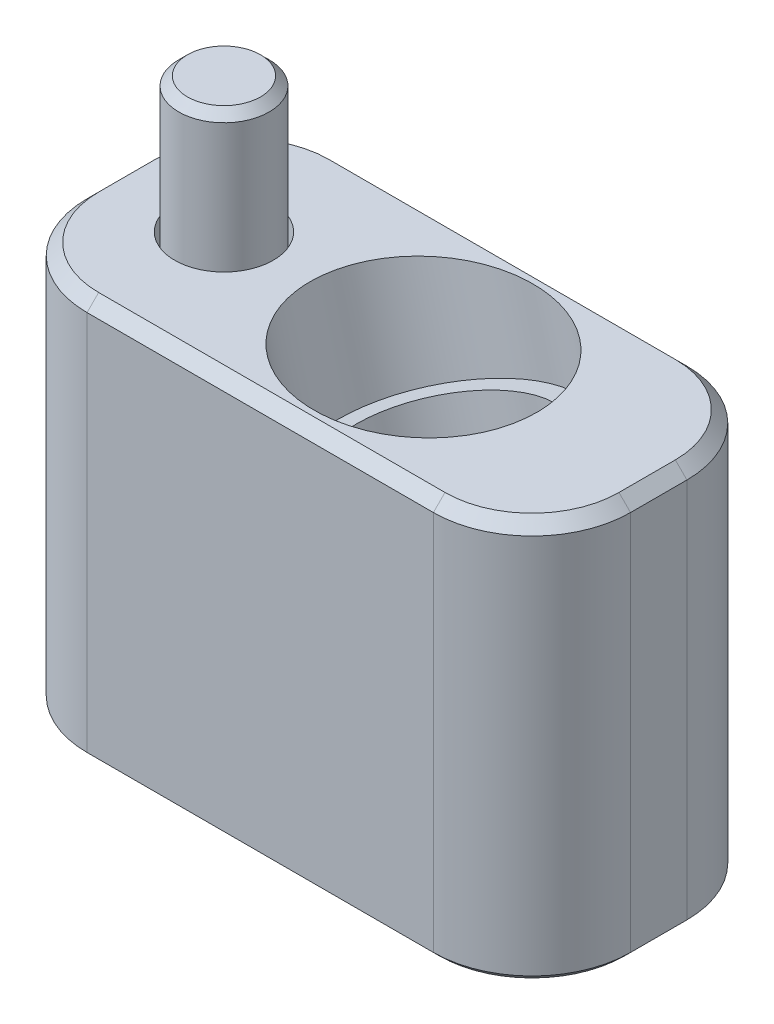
ISO-10303-21;
HEADER;
FILE_DESCRIPTION(('STEP AP214'),'2;1');
FILE_NAME('part.step','',(''),(''),'','','');
FILE_SCHEMA(('AUTOMOTIVE_DESIGN { 1 0 10303 214 1 1 1 1 }'));
ENDSEC;
DATA;
#1=APPLICATION_CONTEXT('core data for automotive mechanical design processes');
#2=APPLICATION_PROTOCOL_DEFINITION('international standard','automotive_design',2000,#1);
#3=PRODUCT_CONTEXT('',#1,'mechanical');
#4=PRODUCT('Part','Part','',(#3));
#5=PRODUCT_RELATED_PRODUCT_CATEGORY('part','',(#4));
#6=PRODUCT_DEFINITION_FORMATION('','',#4);
#7=PRODUCT_DEFINITION_CONTEXT('part definition',#1,'design');
#8=PRODUCT_DEFINITION('design','',#6,#7);
#9=PRODUCT_DEFINITION_SHAPE('','',#8);
#10=(LENGTH_UNIT() NAMED_UNIT(*) SI_UNIT(.MILLI.,.METRE.));
#11=(NAMED_UNIT(*) PLANE_ANGLE_UNIT() SI_UNIT($,.RADIAN.));
#12=(NAMED_UNIT(*) SI_UNIT($,.STERADIAN.) SOLID_ANGLE_UNIT());
#13=UNCERTAINTY_MEASURE_WITH_UNIT(LENGTH_MEASURE(1.E-05),#10,'distance_accuracy_value','');
#14=(GEOMETRIC_REPRESENTATION_CONTEXT(3) GLOBAL_UNCERTAINTY_ASSIGNED_CONTEXT((#13)) GLOBAL_UNIT_ASSIGNED_CONTEXT((#10,
#11,#12)) REPRESENTATION_CONTEXT('',''));
#15=CARTESIAN_POINT('',(0.,0.,0.));
#16=DIRECTION('',(0.,0.,1.));
#17=DIRECTION('',(1.,0.,0.));
#18=AXIS2_PLACEMENT_3D('',#15,#16,#17);
#19=CARTESIAN_POINT('',(-17.4752,11.8364,0.));
#20=DIRECTION('',(0.,1.,0.));
#21=DIRECTION('',(1.,0.,0.));
#22=AXIS2_PLACEMENT_3D('',#19,#20,#21);
#23=PLANE('',#22);
#24=CARTESIAN_POINT('',(-17.4752,11.8364,0.));
#25=DIRECTION('',(0.,1.,0.));
#26=DIRECTION('',(1.,0.,0.));
#27=AXIS2_PLACEMENT_3D('',#24,#25,#26);
#28=CIRCLE('',#27,3.20040000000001);
#29=CARTESIAN_POINT('',(-14.2748,11.8364,0.));
#30=VERTEX_POINT('',#29);
#31=EDGE_CURVE('E163',#30,#30,#28,.T.);
#32=ORIENTED_EDGE('',*,*,#31,.T.);
#33=EDGE_LOOP('',(#32));
#34=FACE_BOUND('',#33,.T.);
#35=ADVANCED_FACE('F50',(#34),#23,.T.);
#36=CARTESIAN_POINT('',(-17.4752,11.8364,0.));
#37=DIRECTION('',(0.,1.,0.));
#38=DIRECTION('',(1.,0.,0.));
#39=AXIS2_PLACEMENT_3D('',#36,#37,#38);
#40=CYLINDRICAL_SURFACE('',#39,3.9624);
#41=CARTESIAN_POINT('',(-17.4752,11.0744,0.));
#42=DIRECTION('',(0.,1.,0.));
#43=DIRECTION('',(1.,0.,0.));
#44=AXIS2_PLACEMENT_3D('',#41,#42,#43);
#45=CIRCLE('',#44,3.9624);
#46=CARTESIAN_POINT('',(-13.5128,11.0744,0.));
#47=VERTEX_POINT('',#46);
#48=EDGE_CURVE('E166',#47,#47,#45,.F.);
#49=ORIENTED_EDGE('',*,*,#48,.T.);
#50=EDGE_LOOP('',(#49));
#51=FACE_BOUND('',#50,.T.);
#52=CARTESIAN_POINT('',(-17.4752,-26.2636,0.));
#53=DIRECTION('',(0.,1.,0.));
#54=DIRECTION('',(1.,0.,0.));
#55=AXIS2_PLACEMENT_3D('',#52,#53,#54);
#56=CIRCLE('',#55,3.9624);
#57=CARTESIAN_POINT('',(-13.5128,-26.2636,0.));
#58=VERTEX_POINT('',#57);
#59=EDGE_CURVE('E160',#58,#58,#56,.T.);
#60=ORIENTED_EDGE('',*,*,#59,.T.);
#61=EDGE_LOOP('',(#60));
#62=FACE_BOUND('',#61,.T.);
#63=ADVANCED_FACE('F183',(#51,#62),#40,.T.);
#64=CARTESIAN_POINT('',(-17.4752,-26.2636,3.9624));
#65=DIRECTION('',(0.,1.,0.));
#66=DIRECTION('',(1.,0.,0.));
#67=AXIS2_PLACEMENT_3D('',#64,#65,#66);
#68=PLANE('',#67);
#69=CARTESIAN_POINT('',(-17.4752,-26.2636,0.));
#70=DIRECTION('',(0.,1.,0.));
#71=DIRECTION('',(1.,0.,0.));
#72=AXIS2_PLACEMENT_3D('',#69,#70,#71);
#73=CIRCLE('',#72,5.9436);
#74=CARTESIAN_POINT('',(-11.5316,-26.2636,0.));
#75=VERTEX_POINT('',#74);
#76=EDGE_CURVE('E152',#75,#75,#73,.T.);
#77=ORIENTED_EDGE('',*,*,#76,.T.);
#78=EDGE_LOOP('',(#77));
#79=FACE_BOUND('',#78,.T.);
#80=ORIENTED_EDGE('',*,*,#59,.F.);
#81=EDGE_LOOP('',(#80));
#82=FACE_BOUND('',#81,.T.);
#83=ADVANCED_FACE('F189',(#79,#82),#68,.T.);
#84=CARTESIAN_POINT('',(-17.4752,11.8364,0.));
#85=DIRECTION('',(0.,1.,0.));
#86=DIRECTION('',(1.,0.,0.));
#87=AXIS2_PLACEMENT_3D('',#84,#85,#86);
#88=CYLINDRICAL_SURFACE('',#87,5.9436);
#89=CARTESIAN_POINT('',(-17.4752,-33.6804,0.));
#90=DIRECTION('',(0.,-1.,0.));
#91=DIRECTION('',(-1.,0.,0.));
#92=AXIS2_PLACEMENT_3D('',#89,#90,#91);
#93=CIRCLE('',#92,5.9436);
#94=CARTESIAN_POINT('',(-23.4188,-33.6804,0.));
#95=VERTEX_POINT('',#94);
#96=EDGE_CURVE('E58',#95,#95,#93,.F.);
#97=ORIENTED_EDGE('',*,*,#96,.T.);
#98=EDGE_LOOP('',(#97));
#99=FACE_BOUND('',#98,.T.);
#100=ORIENTED_EDGE('',*,*,#76,.F.);
#101=EDGE_LOOP('',(#100));
#102=FACE_BOUND('',#101,.T.);
#103=ADVANCED_FACE('F171',(#99,#102),#88,.T.);
#104=CARTESIAN_POINT('',(-17.4752,-34.1884,5.9436));
#105=DIRECTION('',(0.,-1.,0.));
#106=DIRECTION('',(-1.,0.,0.));
#107=AXIS2_PLACEMENT_3D('',#104,#105,#106);
#108=PLANE('',#107);
#109=CARTESIAN_POINT('',(-17.4752,-34.1884,0.));
#110=DIRECTION('',(0.,-1.,0.));
#111=DIRECTION('',(-1.,0.,0.));
#112=AXIS2_PLACEMENT_3D('',#109,#110,#111);
#113=CIRCLE('',#112,5.43560000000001);
#114=CARTESIAN_POINT('',(-22.9108,-34.1884,0.));
#115=VERTEX_POINT('',#114);
#116=EDGE_CURVE('E12',#115,#115,#113,.T.);
#117=ORIENTED_EDGE('',*,*,#116,.T.);
#118=EDGE_LOOP('',(#117));
#119=FACE_BOUND('',#118,.T.);
#120=DIRECTION('',(0.866025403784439,0.,0.5));
#121=VECTOR('',#120,1.);
#122=CARTESIAN_POINT('',(-17.4752,-34.1884,-3.66617420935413));
#123=LINE('',#122,#121);
#124=CARTESIAN_POINT('',(-17.4752,-34.1884,-3.66617420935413));
#125=VERTEX_POINT('',#124);
#126=CARTESIAN_POINT('',(-14.3002,-34.1884,-1.83308710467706));
#127=VERTEX_POINT('',#126);
#128=EDGE_CURVE('E65',#125,#127,#123,.T.);
#129=ORIENTED_EDGE('',*,*,#128,.F.);
#130=DIRECTION('',(0.866025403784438,0.,-0.5));
#131=VECTOR('',#130,1.);
#132=CARTESIAN_POINT('',(-20.6502,-34.1884,-1.83308710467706));
#133=LINE('',#132,#131);
#134=CARTESIAN_POINT('',(-20.6502,-34.1884,-1.83308710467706));
#135=VERTEX_POINT('',#134);
#136=EDGE_CURVE('E148',#135,#125,#133,.T.);
#137=ORIENTED_EDGE('',*,*,#136,.F.);
#138=DIRECTION('',(0.,0.,-1.));
#139=VECTOR('',#138,1.);
#140=CARTESIAN_POINT('',(-20.6502,-34.1884,1.83308710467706));
#141=LINE('',#140,#139);
#142=CARTESIAN_POINT('',(-20.6502,-34.1884,1.83308710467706));
#143=VERTEX_POINT('',#142);
#144=EDGE_CURVE('E146',#143,#135,#141,.T.);
#145=ORIENTED_EDGE('',*,*,#144,.F.);
#146=DIRECTION('',(-0.866025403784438,0.,-0.5));
#147=VECTOR('',#146,1.);
#148=CARTESIAN_POINT('',(-17.4752,-34.1884,3.66617420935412));
#149=LINE('',#148,#147);
#150=CARTESIAN_POINT('',(-17.4752,-34.1884,3.66617420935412));
#151=VERTEX_POINT('',#150);
#152=EDGE_CURVE('E113',#151,#143,#149,.T.);
#153=ORIENTED_EDGE('',*,*,#152,.F.);
#154=DIRECTION('',(-0.866025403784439,0.,0.5));
#155=VECTOR('',#154,1.);
#156=CARTESIAN_POINT('',(-14.3002,-34.1884,1.83308710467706));
#157=LINE('',#156,#155);
#158=CARTESIAN_POINT('',(-14.3002,-34.1884,1.83308710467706));
#159=VERTEX_POINT('',#158);
#160=EDGE_CURVE('E142',#159,#151,#157,.T.);
#161=ORIENTED_EDGE('',*,*,#160,.F.);
#162=DIRECTION('',(0.,0.,1.));
#163=VECTOR('',#162,1.);
#164=CARTESIAN_POINT('',(-14.3002,-34.1884,-1.83308710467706));
#165=LINE('',#164,#163);
#166=EDGE_CURVE('E139',#127,#159,#165,.T.);
#167=ORIENTED_EDGE('',*,*,#166,.F.);
#168=EDGE_LOOP('',(#129,#137,#145,#153,#161,#167));
#169=FACE_BOUND('',#168,.T.);
#170=ADVANCED_FACE('F198',(#119,#169),#108,.T.);
#171=CARTESIAN_POINT('',(-17.4752,-29.3624,-3.66617420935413));
#172=DIRECTION('',(0.5,0.,-0.866025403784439));
#173=DIRECTION('',(-0.866025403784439,0.,-0.5));
#174=AXIS2_PLACEMENT_3D('',#171,#172,#173);
#175=PLANE('',#174);
#176=ORIENTED_EDGE('',*,*,#128,.T.);
#177=DIRECTION('',(0.,-1.,0.));
#178=VECTOR('',#177,1.);
#179=CARTESIAN_POINT('',(-14.3002,-29.3624,-1.83308710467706));
#180=LINE('',#179,#178);
#181=CARTESIAN_POINT('',(-14.3002,-29.3624,-1.83308710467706));
#182=VERTEX_POINT('',#181);
#183=EDGE_CURVE('E95',#182,#127,#180,.T.);
#184=ORIENTED_EDGE('',*,*,#183,.F.);
#185=DIRECTION('',(0.866025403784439,0.,0.5));
#186=VECTOR('',#185,1.);
#187=CARTESIAN_POINT('',(-17.4752,-29.3624,-3.66617420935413));
#188=LINE('',#187,#186);
#189=CARTESIAN_POINT('',(-17.4752,-29.3624,-3.66617420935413));
#190=VERTEX_POINT('',#189);
#191=EDGE_CURVE('E150',#190,#182,#188,.T.);
#192=ORIENTED_EDGE('',*,*,#191,.F.);
#193=DIRECTION('',(0.,-1.,0.));
#194=VECTOR('',#193,1.);
#195=CARTESIAN_POINT('',(-17.4752,-29.3624,-3.66617420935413));
#196=LINE('',#195,#194);
#197=EDGE_CURVE('E73',#190,#125,#196,.T.);
#198=ORIENTED_EDGE('',*,*,#197,.T.);
#199=EDGE_LOOP('',(#176,#184,#192,#198));
#200=FACE_BOUND('',#199,.T.);
#201=ADVANCED_FACE('F201',(#200),#175,.F.);
#202=CARTESIAN_POINT('',(-20.6502,-29.3624,-1.83308710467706));
#203=DIRECTION('',(-0.5,0.,-0.866025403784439));
#204=DIRECTION('',(-0.866025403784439,0.,0.5));
#205=AXIS2_PLACEMENT_3D('',#202,#203,#204);
#206=PLANE('',#205);
#207=ORIENTED_EDGE('',*,*,#136,.T.);
#208=ORIENTED_EDGE('',*,*,#197,.F.);
#209=DIRECTION('',(0.866025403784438,0.,-0.5));
#210=VECTOR('',#209,1.);
#211=CARTESIAN_POINT('',(-20.6502,-29.3624,-1.83308710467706));
#212=LINE('',#211,#210);
#213=CARTESIAN_POINT('',(-20.6502,-29.3624,-1.83308710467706));
#214=VERTEX_POINT('',#213);
#215=EDGE_CURVE('E125',#214,#190,#212,.T.);
#216=ORIENTED_EDGE('',*,*,#215,.F.);
#217=DIRECTION('',(0.,-1.,0.));
#218=VECTOR('',#217,1.);
#219=CARTESIAN_POINT('',(-20.6502,-29.3624,-1.83308710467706));
#220=LINE('',#219,#218);
#221=EDGE_CURVE('E117',#214,#135,#220,.T.);
#222=ORIENTED_EDGE('',*,*,#221,.T.);
#223=EDGE_LOOP('',(#207,#208,#216,#222));
#224=FACE_BOUND('',#223,.T.);
#225=ADVANCED_FACE('F205',(#224),#206,.F.);
#226=CARTESIAN_POINT('',(-20.6502,-29.3624,1.83308710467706));
#227=DIRECTION('',(-1.,0.,0.));
#228=DIRECTION('',(0.,0.,1.));
#229=AXIS2_PLACEMENT_3D('',#226,#227,#228);
#230=PLANE('',#229);
#231=ORIENTED_EDGE('',*,*,#144,.T.);
#232=ORIENTED_EDGE('',*,*,#221,.F.);
#233=DIRECTION('',(0.,0.,-1.));
#234=VECTOR('',#233,1.);
#235=CARTESIAN_POINT('',(-20.6502,-29.3624,1.83308710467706));
#236=LINE('',#235,#234);
#237=CARTESIAN_POINT('',(-20.6502,-29.3624,1.83308710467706));
#238=VERTEX_POINT('',#237);
#239=EDGE_CURVE('E121',#238,#214,#236,.T.);
#240=ORIENTED_EDGE('',*,*,#239,.F.);
#241=DIRECTION('',(0.,-1.,0.));
#242=VECTOR('',#241,1.);
#243=CARTESIAN_POINT('',(-20.6502,-29.3624,1.83308710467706));
#244=LINE('',#243,#242);
#245=EDGE_CURVE('E106',#238,#143,#244,.T.);
#246=ORIENTED_EDGE('',*,*,#245,.T.);
#247=EDGE_LOOP('',(#231,#232,#240,#246));
#248=FACE_BOUND('',#247,.T.);
#249=ADVANCED_FACE('F122',(#248),#230,.F.);
#250=CARTESIAN_POINT('',(-17.4752,-29.3624,3.66617420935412));
#251=DIRECTION('',(-0.5,0.,0.866025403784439));
#252=DIRECTION('',(0.866025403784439,0.,0.5));
#253=AXIS2_PLACEMENT_3D('',#250,#251,#252);
#254=PLANE('',#253);
#255=ORIENTED_EDGE('',*,*,#152,.T.);
#256=ORIENTED_EDGE('',*,*,#245,.F.);
#257=DIRECTION('',(-0.866025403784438,0.,-0.5));
#258=VECTOR('',#257,1.);
#259=CARTESIAN_POINT('',(-17.4752,-29.3624,3.66617420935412));
#260=LINE('',#259,#258);
#261=CARTESIAN_POINT('',(-17.4752,-29.3624,3.66617420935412));
#262=VERTEX_POINT('',#261);
#263=EDGE_CURVE('E110',#262,#238,#260,.T.);
#264=ORIENTED_EDGE('',*,*,#263,.F.);
#265=DIRECTION('',(0.,-1.,0.));
#266=VECTOR('',#265,1.);
#267=CARTESIAN_POINT('',(-17.4752,-29.3624,3.66617420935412));
#268=LINE('',#267,#266);
#269=EDGE_CURVE('E118',#262,#151,#268,.T.);
#270=ORIENTED_EDGE('',*,*,#269,.T.);
#271=EDGE_LOOP('',(#255,#256,#264,#270));
#272=FACE_BOUND('',#271,.T.);
#273=ADVANCED_FACE('F108',(#272),#254,.F.);
#274=CARTESIAN_POINT('',(-14.3002,-29.3624,1.83308710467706));
#275=DIRECTION('',(0.5,0.,0.866025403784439));
#276=DIRECTION('',(0.866025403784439,0.,-0.5));
#277=AXIS2_PLACEMENT_3D('',#274,#275,#276);
#278=PLANE('',#277);
#279=ORIENTED_EDGE('',*,*,#160,.T.);
#280=ORIENTED_EDGE('',*,*,#269,.F.);
#281=DIRECTION('',(-0.866025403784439,0.,0.5));
#282=VECTOR('',#281,1.);
#283=CARTESIAN_POINT('',(-14.3002,-29.3624,1.83308710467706));
#284=LINE('',#283,#282);
#285=CARTESIAN_POINT('',(-14.3002,-29.3624,1.83308710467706));
#286=VERTEX_POINT('',#285);
#287=EDGE_CURVE('E131',#286,#262,#284,.T.);
#288=ORIENTED_EDGE('',*,*,#287,.F.);
#289=DIRECTION('',(0.,-1.,0.));
#290=VECTOR('',#289,1.);
#291=CARTESIAN_POINT('',(-14.3002,-29.3624,1.83308710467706));
#292=LINE('',#291,#290);
#293=EDGE_CURVE('E155',#286,#159,#292,.T.);
#294=ORIENTED_EDGE('',*,*,#293,.T.);
#295=EDGE_LOOP('',(#279,#280,#288,#294));
#296=FACE_BOUND('',#295,.T.);
#297=ADVANCED_FACE('F209',(#296),#278,.F.);
#298=CARTESIAN_POINT('',(-14.3002,-29.3624,-1.83308710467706));
#299=DIRECTION('',(1.,0.,0.));
#300=DIRECTION('',(0.,-1.,0.));
#301=AXIS2_PLACEMENT_3D('',#298,#299,#300);
#302=PLANE('',#301);
#303=ORIENTED_EDGE('',*,*,#166,.T.);
#304=ORIENTED_EDGE('',*,*,#293,.F.);
#305=DIRECTION('',(0.,0.,1.));
#306=VECTOR('',#305,1.);
#307=CARTESIAN_POINT('',(-14.3002,-29.3624,-1.83308710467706));
#308=LINE('',#307,#306);
#309=EDGE_CURVE('E133',#182,#286,#308,.T.);
#310=ORIENTED_EDGE('',*,*,#309,.F.);
#311=ORIENTED_EDGE('',*,*,#183,.T.);
#312=EDGE_LOOP('',(#303,#304,#310,#311));
#313=FACE_BOUND('',#312,.T.);
#314=ADVANCED_FACE('F206',(#313),#302,.F.);
#315=CARTESIAN_POINT('',(-17.4752,-29.3624,-3.66617420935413));
#316=DIRECTION('',(0.,1.,0.));
#317=DIRECTION('',(1.,0.,0.));
#318=AXIS2_PLACEMENT_3D('',#315,#316,#317);
#319=PLANE('',#318);
#320=ORIENTED_EDGE('',*,*,#191,.T.);
#321=ORIENTED_EDGE('',*,*,#309,.T.);
#322=ORIENTED_EDGE('',*,*,#287,.T.);
#323=ORIENTED_EDGE('',*,*,#263,.T.);
#324=ORIENTED_EDGE('',*,*,#239,.T.);
#325=ORIENTED_EDGE('',*,*,#215,.T.);
#326=EDGE_LOOP('',(#320,#321,#322,#323,#324,#325));
#327=FACE_BOUND('',#326,.T.);
#328=ADVANCED_FACE('F128',(#327),#319,.F.);
#329=CARTESIAN_POINT('',(-17.4752,11.8364,0.));
#330=DIRECTION('',(0.,-1.,0.));
#331=DIRECTION('',(-1.,0.,0.));
#332=AXIS2_PLACEMENT_3D('',#329,#330,#331);
#333=CONICAL_SURFACE('',#332,3.20040000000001,0.785398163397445);
#334=ORIENTED_EDGE('',*,*,#48,.F.);
#335=EDGE_LOOP('',(#334));
#336=FACE_BOUND('',#335,.T.);
#337=ORIENTED_EDGE('',*,*,#31,.F.);
#338=EDGE_LOOP('',(#337));
#339=FACE_BOUND('',#338,.T.);
#340=ADVANCED_FACE('F175',(#336,#339),#333,.T.);
#341=CARTESIAN_POINT('',(-17.4752,-33.6804,0.));
#342=DIRECTION('',(0.,1.,0.));
#343=DIRECTION('',(1.,0.,0.));
#344=AXIS2_PLACEMENT_3D('',#341,#342,#343);
#345=CONICAL_SURFACE('',#344,5.9436,0.785398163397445);
#346=ORIENTED_EDGE('',*,*,#116,.F.);
#347=EDGE_LOOP('',(#346));
#348=FACE_BOUND('',#347,.T.);
#349=ORIENTED_EDGE('',*,*,#96,.F.);
#350=EDGE_LOOP('',(#349));
#351=FACE_BOUND('',#350,.T.);
#352=ADVANCED_FACE('F52',(#348,#351),#345,.T.);
#353=CLOSED_SHELL('',(#35,#63,#83,#103,#170,#201,#225,#249,#273,#297,#314,#328,#340,#352));
#354=MANIFOLD_SOLID_BREP('B2',#353);
#355=CARTESIAN_POINT('',(11.9761,-34.8996,-2.47015));
#356=DIRECTION('',(0.,1.,0.));
#357=DIRECTION('',(0.,0.,1.));
#358=AXIS2_PLACEMENT_3D('',#355,#356,#357);
#359=CYLINDRICAL_SURFACE('',#358,8.636);
#360=DIRECTION('',(0.,1.,0.));
#361=VECTOR('',#360,1.);
#362=CARTESIAN_POINT('',(20.6121,-34.8996,-2.47015));
#363=LINE('',#362,#361);
#364=CARTESIAN_POINT('',(20.6121,-34.3916,-2.47015));
#365=VERTEX_POINT('',#364);
#366=CARTESIAN_POINT('',(20.6121,-1.016,-2.47015));
#367=VERTEX_POINT('',#366);
#368=EDGE_CURVE('E424',#365,#367,#363,.T.);
#369=ORIENTED_EDGE('',*,*,#368,.F.);
#370=CARTESIAN_POINT('',(11.9761,-34.3916,-2.47015));
#371=DIRECTION('',(0.,-1.,0.));
#372=DIRECTION('',(0.,0.,-1.));
#373=AXIS2_PLACEMENT_3D('',#370,#371,#372);
#374=CIRCLE('',#373,8.636);
#375=CARTESIAN_POINT('',(11.9761,-34.3916,-11.10615));
#376=VERTEX_POINT('',#375);
#377=EDGE_CURVE('E466',#365,#376,#374,.F.);
#378=ORIENTED_EDGE('',*,*,#377,.T.);
#379=DIRECTION('',(0.,1.,0.));
#380=VECTOR('',#379,1.);
#381=CARTESIAN_POINT('',(11.9761,-34.8996,-11.10615));
#382=LINE('',#381,#380);
#383=CARTESIAN_POINT('',(11.9761,-1.016,-11.10615));
#384=VERTEX_POINT('',#383);
#385=EDGE_CURVE('E535',#376,#384,#382,.T.);
#386=ORIENTED_EDGE('',*,*,#385,.T.);
#387=CARTESIAN_POINT('',(11.9761,-1.016,-2.47015));
#388=DIRECTION('',(0.,-1.,0.));
#389=DIRECTION('',(0.,0.,-1.));
#390=AXIS2_PLACEMENT_3D('',#387,#388,#389);
#391=CIRCLE('',#390,8.636);
#392=EDGE_CURVE('E558',#384,#367,#391,.T.);
#393=ORIENTED_EDGE('',*,*,#392,.T.);
#394=EDGE_LOOP('',(#369,#378,#386,#393));
#395=FACE_BOUND('',#394,.T.);
#396=ADVANCED_FACE('F287',(#395),#359,.T.);
#397=CARTESIAN_POINT('',(20.6121,-34.8996,2.47015));
#398=DIRECTION('',(1.,0.,0.));
#399=DIRECTION('',(0.,0.,-1.));
#400=AXIS2_PLACEMENT_3D('',#397,#398,#399);
#401=PLANE('',#400);
#402=DIRECTION('',(0.,1.,0.));
#403=VECTOR('',#402,1.);
#404=CARTESIAN_POINT('',(20.6121,-34.8996,2.47015));
#405=LINE('',#404,#403);
#406=CARTESIAN_POINT('',(20.6121,-34.3916,2.47015));
#407=VERTEX_POINT('',#406);
#408=CARTESIAN_POINT('',(20.6121,-1.016,2.47015));
#409=VERTEX_POINT('',#408);
#410=EDGE_CURVE('E523',#407,#409,#405,.T.);
#411=ORIENTED_EDGE('',*,*,#410,.F.);
#412=DIRECTION('',(0.,0.,-1.));
#413=VECTOR('',#412,1.);
#414=CARTESIAN_POINT('',(20.6121,-34.3916,2.47015));
#415=LINE('',#414,#413);
#416=EDGE_CURVE('E470',#407,#365,#415,.T.);
#417=ORIENTED_EDGE('',*,*,#416,.T.);
#418=ORIENTED_EDGE('',*,*,#368,.T.);
#419=DIRECTION('',(0.,0.,1.));
#420=VECTOR('',#419,1.);
#421=CARTESIAN_POINT('',(20.6121,-1.016,2.47015));
#422=LINE('',#421,#420);
#423=EDGE_CURVE('E564',#367,#409,#422,.T.);
#424=ORIENTED_EDGE('',*,*,#423,.T.);
#425=EDGE_LOOP('',(#411,#417,#418,#424));
#426=FACE_BOUND('',#425,.T.);
#427=ADVANCED_FACE('F650',(#426),#401,.T.);
#428=CARTESIAN_POINT('',(11.9761,-34.8996,2.47015));
#429=DIRECTION('',(0.,1.,0.));
#430=DIRECTION('',(0.,0.,1.));
#431=AXIS2_PLACEMENT_3D('',#428,#429,#430);
#432=CYLINDRICAL_SURFACE('',#431,8.636);
#433=DIRECTION('',(0.,1.,0.));
#434=VECTOR('',#433,1.);
#435=CARTESIAN_POINT('',(11.9761,-34.8996,11.10615));
#436=LINE('',#435,#434);
#437=CARTESIAN_POINT('',(11.9761,-34.3916,11.10615));
#438=VERTEX_POINT('',#437);
#439=CARTESIAN_POINT('',(11.9761,-1.016,11.10615));
#440=VERTEX_POINT('',#439);
#441=EDGE_CURVE('E525',#438,#440,#436,.T.);
#442=ORIENTED_EDGE('',*,*,#441,.F.);
#443=CARTESIAN_POINT('',(11.9761,-34.3916,2.47015));
#444=DIRECTION('',(0.,-1.,0.));
#445=DIRECTION('',(0.,0.,-1.));
#446=AXIS2_PLACEMENT_3D('',#443,#444,#445);
#447=CIRCLE('',#446,8.636);
#448=EDGE_CURVE('E296',#438,#407,#447,.F.);
#449=ORIENTED_EDGE('',*,*,#448,.T.);
#450=ORIENTED_EDGE('',*,*,#410,.T.);
#451=CARTESIAN_POINT('',(11.9761,-1.016,2.47015));
#452=DIRECTION('',(0.,-1.,0.));
#453=DIRECTION('',(0.,0.,-1.));
#454=AXIS2_PLACEMENT_3D('',#451,#452,#453);
#455=CIRCLE('',#454,8.636);
#456=EDGE_CURVE('E568',#409,#440,#455,.T.);
#457=ORIENTED_EDGE('',*,*,#456,.T.);
#458=EDGE_LOOP('',(#442,#449,#450,#457));
#459=FACE_BOUND('',#458,.T.);
#460=ADVANCED_FACE('F648',(#459),#432,.T.);
#461=CARTESIAN_POINT('',(11.9761,-34.8996,11.10615));
#462=DIRECTION('',(0.,0.,1.));
#463=DIRECTION('',(1.,0.,0.));
#464=AXIS2_PLACEMENT_3D('',#461,#462,#463);
#465=PLANE('',#464);
#466=DIRECTION('',(0.,1.,0.));
#467=VECTOR('',#466,1.);
#468=CARTESIAN_POINT('',(-18.3642,-34.8996,11.10615));
#469=LINE('',#468,#467);
#470=CARTESIAN_POINT('',(-18.3642,-34.3916,11.10615));
#471=VERTEX_POINT('',#470);
#472=CARTESIAN_POINT('',(-18.3642,-1.016,11.10615));
#473=VERTEX_POINT('',#472);
#474=EDGE_CURVE('E527',#471,#473,#469,.T.);
#475=ORIENTED_EDGE('',*,*,#474,.F.);
#476=DIRECTION('',(1.,0.,0.));
#477=VECTOR('',#476,1.);
#478=CARTESIAN_POINT('',(11.9761,-34.3916,11.10615));
#479=LINE('',#478,#477);
#480=EDGE_CURVE('E48',#471,#438,#479,.T.);
#481=ORIENTED_EDGE('',*,*,#480,.T.);
#482=ORIENTED_EDGE('',*,*,#441,.T.);
#483=DIRECTION('',(-1.,0.,0.));
#484=VECTOR('',#483,1.);
#485=CARTESIAN_POINT('',(-18.3642,-1.016,11.10615));
#486=LINE('',#485,#484);
#487=EDGE_CURVE('E447',#440,#473,#486,.T.);
#488=ORIENTED_EDGE('',*,*,#487,.T.);
#489=EDGE_LOOP('',(#475,#481,#482,#488));
#490=FACE_BOUND('',#489,.T.);
#491=ADVANCED_FACE('F592',(#490),#465,.T.);
#492=CARTESIAN_POINT('',(-18.3642,-34.8996,2.47015));
#493=DIRECTION('',(0.,1.,0.));
#494=DIRECTION('',(0.,0.,1.));
#495=AXIS2_PLACEMENT_3D('',#492,#493,#494);
#496=CYLINDRICAL_SURFACE('',#495,8.636);
#497=DIRECTION('',(0.,1.,0.));
#498=VECTOR('',#497,1.);
#499=CARTESIAN_POINT('',(-27.0002,-34.8996,2.47015));
#500=LINE('',#499,#498);
#501=CARTESIAN_POINT('',(-27.0002,-34.3916,2.47015));
#502=VERTEX_POINT('',#501);
#503=CARTESIAN_POINT('',(-27.0002,-1.016,2.47015));
#504=VERTEX_POINT('',#503);
#505=EDGE_CURVE('E529',#502,#504,#500,.T.);
#506=ORIENTED_EDGE('',*,*,#505,.F.);
#507=CARTESIAN_POINT('',(-18.3642,-34.3916,2.47015));
#508=DIRECTION('',(0.,-1.,0.));
#509=DIRECTION('',(0.,0.,-1.));
#510=AXIS2_PLACEMENT_3D('',#507,#508,#509);
#511=CIRCLE('',#510,8.636);
#512=EDGE_CURVE('E310',#502,#471,#511,.F.);
#513=ORIENTED_EDGE('',*,*,#512,.T.);
#514=ORIENTED_EDGE('',*,*,#474,.T.);
#515=CARTESIAN_POINT('',(-18.3642,-1.016,2.47015));
#516=DIRECTION('',(0.,-1.,0.));
#517=DIRECTION('',(0.,0.,-1.));
#518=AXIS2_PLACEMENT_3D('',#515,#516,#517);
#519=CIRCLE('',#518,8.636);
#520=EDGE_CURVE('E428',#473,#504,#519,.T.);
#521=ORIENTED_EDGE('',*,*,#520,.T.);
#522=EDGE_LOOP('',(#506,#513,#514,#521));
#523=FACE_BOUND('',#522,.T.);
#524=ADVANCED_FACE('F591',(#523),#496,.T.);
#525=CARTESIAN_POINT('',(-27.0002,-34.8996,2.47015));
#526=DIRECTION('',(-1.,0.,0.));
#527=DIRECTION('',(0.,0.,1.));
#528=AXIS2_PLACEMENT_3D('',#525,#526,#527);
#529=PLANE('',#528);
#530=DIRECTION('',(0.,1.,0.));
#531=VECTOR('',#530,1.);
#532=CARTESIAN_POINT('',(-27.0002,-34.8996,-2.47015));
#533=LINE('',#532,#531);
#534=CARTESIAN_POINT('',(-27.0002,-34.3916,-2.47015));
#535=VERTEX_POINT('',#534);
#536=CARTESIAN_POINT('',(-27.0002,-1.016,-2.47015));
#537=VERTEX_POINT('',#536);
#538=EDGE_CURVE('E531',#535,#537,#533,.T.);
#539=ORIENTED_EDGE('',*,*,#538,.F.);
#540=DIRECTION('',(0.,0.,1.));
#541=VECTOR('',#540,1.);
#542=CARTESIAN_POINT('',(-27.0002,-34.3916,2.47015));
#543=LINE('',#542,#541);
#544=EDGE_CURVE('E468',#535,#502,#543,.T.);
#545=ORIENTED_EDGE('',*,*,#544,.T.);
#546=ORIENTED_EDGE('',*,*,#505,.T.);
#547=DIRECTION('',(0.,0.,-1.));
#548=VECTOR('',#547,1.);
#549=CARTESIAN_POINT('',(-27.0002,-1.016,-2.47015));
#550=LINE('',#549,#548);
#551=EDGE_CURVE('E561',#504,#537,#550,.T.);
#552=ORIENTED_EDGE('',*,*,#551,.T.);
#553=EDGE_LOOP('',(#539,#545,#546,#552));
#554=FACE_BOUND('',#553,.T.);
#555=ADVANCED_FACE('F589',(#554),#529,.T.);
#556=CARTESIAN_POINT('',(-18.3642,-34.8996,-2.47015));
#557=DIRECTION('',(0.,1.,0.));
#558=DIRECTION('',(0.,0.,1.));
#559=AXIS2_PLACEMENT_3D('',#556,#557,#558);
#560=CYLINDRICAL_SURFACE('',#559,8.636);
#561=DIRECTION('',(0.,1.,0.));
#562=VECTOR('',#561,1.);
#563=CARTESIAN_POINT('',(-18.3642,-34.8996,-11.10615));
#564=LINE('',#563,#562);
#565=CARTESIAN_POINT('',(-18.3642,-34.3916,-11.10615));
#566=VERTEX_POINT('',#565);
#567=CARTESIAN_POINT('',(-18.3642,-1.016,-11.10615));
#568=VERTEX_POINT('',#567);
#569=EDGE_CURVE('E533',#566,#568,#564,.T.);
#570=ORIENTED_EDGE('',*,*,#569,.F.);
#571=CARTESIAN_POINT('',(-18.3642,-34.3916,-2.47015));
#572=DIRECTION('',(0.,-1.,0.));
#573=DIRECTION('',(0.,0.,-1.));
#574=AXIS2_PLACEMENT_3D('',#571,#572,#573);
#575=CIRCLE('',#574,8.636);
#576=EDGE_CURVE('E464',#566,#535,#575,.F.);
#577=ORIENTED_EDGE('',*,*,#576,.T.);
#578=ORIENTED_EDGE('',*,*,#538,.T.);
#579=CARTESIAN_POINT('',(-18.3642,-1.016,-2.47015));
#580=DIRECTION('',(0.,-1.,0.));
#581=DIRECTION('',(0.,0.,-1.));
#582=AXIS2_PLACEMENT_3D('',#579,#580,#581);
#583=CIRCLE('',#582,8.636);
#584=EDGE_CURVE('E555',#537,#568,#583,.T.);
#585=ORIENTED_EDGE('',*,*,#584,.T.);
#586=EDGE_LOOP('',(#570,#577,#578,#585));
#587=FACE_BOUND('',#586,.T.);
#588=ADVANCED_FACE('F617',(#587),#560,.T.);
#589=CARTESIAN_POINT('',(11.9761,-34.8996,-11.10615));
#590=DIRECTION('',(0.,0.,-1.));
#591=DIRECTION('',(-1.,0.,0.));
#592=AXIS2_PLACEMENT_3D('',#589,#590,#591);
#593=PLANE('',#592);
#594=ORIENTED_EDGE('',*,*,#385,.F.);
#595=DIRECTION('',(-1.,0.,0.));
#596=VECTOR('',#595,1.);
#597=CARTESIAN_POINT('',(11.9761,-34.3916,-11.10615));
#598=LINE('',#597,#596);
#599=EDGE_CURVE('E443',#376,#566,#598,.T.);
#600=ORIENTED_EDGE('',*,*,#599,.T.);
#601=ORIENTED_EDGE('',*,*,#569,.T.);
#602=DIRECTION('',(1.,0.,0.));
#603=VECTOR('',#602,1.);
#604=CARTESIAN_POINT('',(11.9761,-1.016,-11.10615));
#605=LINE('',#604,#603);
#606=EDGE_CURVE('E552',#568,#384,#605,.T.);
#607=ORIENTED_EDGE('',*,*,#606,.T.);
#608=EDGE_LOOP('',(#594,#600,#601,#607));
#609=FACE_BOUND('',#608,.T.);
#610=ADVANCED_FACE('F620',(#609),#593,.T.);
#611=CARTESIAN_POINT('',(11.9761,-34.8996,-2.47015));
#612=DIRECTION('',(0.,-1.,0.));
#613=DIRECTION('',(0.,0.,-1.));
#614=AXIS2_PLACEMENT_3D('',#611,#612,#613);
#615=PLANE('',#614);
#616=CARTESIAN_POINT('',(-18.3642,-34.8996,-2.47015));
#617=DIRECTION('',(0.,-1.,0.));
#618=DIRECTION('',(0.,0.,-1.));
#619=AXIS2_PLACEMENT_3D('',#616,#617,#618);
#620=CIRCLE('',#619,8.128);
#621=CARTESIAN_POINT('',(-26.4922,-34.8996,-2.47015));
#622=VERTEX_POINT('',#621);
#623=CARTESIAN_POINT('',(-18.3642,-34.8996,-10.59815));
#624=VERTEX_POINT('',#623);
#625=EDGE_CURVE('E459',#622,#624,#620,.T.);
#626=ORIENTED_EDGE('',*,*,#625,.T.);
#627=DIRECTION('',(1.,0.,0.));
#628=VECTOR('',#627,1.);
#629=CARTESIAN_POINT('',(11.9761,-34.8996,-10.59815));
#630=LINE('',#629,#628);
#631=CARTESIAN_POINT('',(11.9761,-34.8996,-10.59815));
#632=VERTEX_POINT('',#631);
#633=EDGE_CURVE('E461',#624,#632,#630,.T.);
#634=ORIENTED_EDGE('',*,*,#633,.T.);
#635=CARTESIAN_POINT('',(11.9761,-34.8996,-2.47015));
#636=DIRECTION('',(0.,-1.,0.));
#637=DIRECTION('',(0.,0.,-1.));
#638=AXIS2_PLACEMENT_3D('',#635,#636,#637);
#639=CIRCLE('',#638,8.128);
#640=CARTESIAN_POINT('',(20.1041,-34.8996,-2.47015));
#641=VERTEX_POINT('',#640);
#642=EDGE_CURVE('E457',#632,#641,#639,.T.);
#643=ORIENTED_EDGE('',*,*,#642,.T.);
#644=DIRECTION('',(0.,0.,1.));
#645=VECTOR('',#644,1.);
#646=CARTESIAN_POINT('',(20.1041,-34.8996,-2.47015000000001));
#647=LINE('',#646,#645);
#648=CARTESIAN_POINT('',(20.1041,-34.8996,2.47015));
#649=VERTEX_POINT('',#648);
#650=EDGE_CURVE('E453',#641,#649,#647,.T.);
#651=ORIENTED_EDGE('',*,*,#650,.T.);
#652=CARTESIAN_POINT('',(11.9761,-34.8996,2.47015));
#653=DIRECTION('',(0.,-1.,0.));
#654=DIRECTION('',(0.,0.,-1.));
#655=AXIS2_PLACEMENT_3D('',#652,#653,#654);
#656=CIRCLE('',#655,8.12800000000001);
#657=CARTESIAN_POINT('',(11.9761,-34.8996,10.59815));
#658=VERTEX_POINT('',#657);
#659=EDGE_CURVE('E449',#649,#658,#656,.T.);
#660=ORIENTED_EDGE('',*,*,#659,.T.);
#661=DIRECTION('',(-1.,0.,0.));
#662=VECTOR('',#661,1.);
#663=CARTESIAN_POINT('',(11.9761,-34.8996,10.59815));
#664=LINE('',#663,#662);
#665=CARTESIAN_POINT('',(-18.3642,-34.8996,10.59815));
#666=VERTEX_POINT('',#665);
#667=EDGE_CURVE('E446',#658,#666,#664,.T.);
#668=ORIENTED_EDGE('',*,*,#667,.T.);
#669=CARTESIAN_POINT('',(-18.3642,-34.8996,2.47015));
#670=DIRECTION('',(0.,-1.,0.));
#671=DIRECTION('',(0.,0.,-1.));
#672=AXIS2_PLACEMENT_3D('',#669,#670,#671);
#673=CIRCLE('',#672,8.12800000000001);
#674=CARTESIAN_POINT('',(-26.4922,-34.8996,2.47015));
#675=VERTEX_POINT('',#674);
#676=EDGE_CURVE('E451',#666,#675,#673,.T.);
#677=ORIENTED_EDGE('',*,*,#676,.T.);
#678=DIRECTION('',(0.,0.,-1.));
#679=VECTOR('',#678,1.);
#680=CARTESIAN_POINT('',(-26.4922,-34.8996,-2.47015000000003));
#681=LINE('',#680,#679);
#682=EDGE_CURVE('E455',#675,#622,#681,.T.);
#683=ORIENTED_EDGE('',*,*,#682,.T.);
#684=EDGE_LOOP('',(#626,#634,#643,#651,#660,#668,#677,#683));
#685=FACE_BOUND('',#684,.T.);
#686=CARTESIAN_POINT('',(-17.4752,-34.8996,0.));
#687=DIRECTION('',(0.,-1.,0.));
#688=DIRECTION('',(0.,0.,-1.));
#689=AXIS2_PLACEMENT_3D('',#686,#687,#688);
#690=CIRCLE('',#689,6.35);
#691=CARTESIAN_POINT('',(-17.4752,-34.8996,-6.35));
#692=VERTEX_POINT('',#691);
#693=EDGE_CURVE('E441',#692,#692,#690,.T.);
#694=ORIENTED_EDGE('',*,*,#693,.F.);
#695=EDGE_LOOP('',(#694));
#696=FACE_BOUND('',#695,.T.);
#697=CARTESIAN_POINT('',(9.35131963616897,-34.8996,0.));
#698=DIRECTION('',(0.,-1.,0.));
#699=DIRECTION('',(-1.,0.,0.));
#700=AXIS2_PLACEMENT_3D('',#697,#698,#699);
#701=ELLIPSE('',#700,8.23722669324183,7.95655);
#702=CARTESIAN_POINT('',(1.11409294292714,-34.8996,0.));
#703=VERTEX_POINT('',#702);
#704=EDGE_CURVE('E537',#703,#703,#701,.T.);
#705=ORIENTED_EDGE('',*,*,#704,.F.);
#706=EDGE_LOOP('',(#705));
#707=FACE_BOUND('',#706,.T.);
#708=ADVANCED_FACE('F639',(#685,#696,#707),#615,.T.);
#709=CARTESIAN_POINT('',(11.9761,0.,-2.47015));
#710=DIRECTION('',(0.,-1.,0.));
#711=DIRECTION('',(0.,0.,-1.));
#712=AXIS2_PLACEMENT_3D('',#709,#710,#711);
#713=PLANE('',#712);
#714=CARTESIAN_POINT('',(-17.4752,0.,0.));
#715=DIRECTION('',(0.,-1.,0.));
#716=DIRECTION('',(0.,0.,-1.));
#717=AXIS2_PLACEMENT_3D('',#714,#715,#716);
#718=CIRCLE('',#717,4.31799999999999);
#719=CARTESIAN_POINT('',(-17.4752,0.,-4.31799999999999));
#720=VERTEX_POINT('',#719);
#721=EDGE_CURVE('E512',#720,#720,#718,.T.);
#722=ORIENTED_EDGE('',*,*,#721,.T.);
#723=EDGE_LOOP('',(#722));
#724=FACE_BOUND('',#723,.T.);
#725=CARTESIAN_POINT('',(11.9761,0.,-2.47015));
#726=DIRECTION('',(0.,-1.,0.));
#727=DIRECTION('',(0.,0.,-1.));
#728=AXIS2_PLACEMENT_3D('',#725,#726,#727);
#729=CIRCLE('',#728,7.62);
#730=CARTESIAN_POINT('',(19.5961,0.,-2.47015));
#731=VERTEX_POINT('',#730);
#732=CARTESIAN_POINT('',(11.9761,0.,-10.09015));
#733=VERTEX_POINT('',#732);
#734=EDGE_CURVE('E545',#731,#733,#729,.F.);
#735=ORIENTED_EDGE('',*,*,#734,.T.);
#736=DIRECTION('',(-1.,0.,0.));
#737=VECTOR('',#736,1.);
#738=CARTESIAN_POINT('',(-18.3642,0.,-10.09015));
#739=LINE('',#738,#737);
#740=CARTESIAN_POINT('',(-18.3642,0.,-10.09015));
#741=VERTEX_POINT('',#740);
#742=EDGE_CURVE('E549',#733,#741,#739,.T.);
#743=ORIENTED_EDGE('',*,*,#742,.T.);
#744=CARTESIAN_POINT('',(-18.3642,0.,-2.47015));
#745=DIRECTION('',(0.,-1.,0.));
#746=DIRECTION('',(0.,0.,-1.));
#747=AXIS2_PLACEMENT_3D('',#744,#745,#746);
#748=CIRCLE('',#747,7.62);
#749=CARTESIAN_POINT('',(-25.9842,0.,-2.47015));
#750=VERTEX_POINT('',#749);
#751=EDGE_CURVE('E547',#741,#750,#748,.F.);
#752=ORIENTED_EDGE('',*,*,#751,.T.);
#753=DIRECTION('',(0.,0.,1.));
#754=VECTOR('',#753,1.);
#755=CARTESIAN_POINT('',(-25.9842,0.,2.47015));
#756=LINE('',#755,#754);
#757=CARTESIAN_POINT('',(-25.9842,0.,2.47015));
#758=VERTEX_POINT('',#757);
#759=EDGE_CURVE('E407',#750,#758,#756,.T.);
#760=ORIENTED_EDGE('',*,*,#759,.T.);
#761=CARTESIAN_POINT('',(-18.3642,0.,2.47015));
#762=DIRECTION('',(0.,-1.,0.));
#763=DIRECTION('',(0.,0.,-1.));
#764=AXIS2_PLACEMENT_3D('',#761,#762,#763);
#765=CIRCLE('',#764,7.62000000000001);
#766=CARTESIAN_POINT('',(-18.3642,0.,10.09015));
#767=VERTEX_POINT('',#766);
#768=EDGE_CURVE('E400',#758,#767,#765,.F.);
#769=ORIENTED_EDGE('',*,*,#768,.T.);
#770=DIRECTION('',(1.,0.,0.));
#771=VECTOR('',#770,1.);
#772=CARTESIAN_POINT('',(11.9761,0.,10.09015));
#773=LINE('',#772,#771);
#774=CARTESIAN_POINT('',(11.9761,0.,10.09015));
#775=VERTEX_POINT('',#774);
#776=EDGE_CURVE('E404',#767,#775,#773,.T.);
#777=ORIENTED_EDGE('',*,*,#776,.T.);
#778=CARTESIAN_POINT('',(11.9761,0.,2.47015));
#779=DIRECTION('',(0.,-1.,0.));
#780=DIRECTION('',(0.,0.,-1.));
#781=AXIS2_PLACEMENT_3D('',#778,#779,#780);
#782=CIRCLE('',#781,7.62000000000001);
#783=CARTESIAN_POINT('',(19.5961,0.,2.47015));
#784=VERTEX_POINT('',#783);
#785=EDGE_CURVE('E413',#775,#784,#782,.F.);
#786=ORIENTED_EDGE('',*,*,#785,.T.);
#787=DIRECTION('',(0.,0.,-1.));
#788=VECTOR('',#787,1.);
#789=CARTESIAN_POINT('',(19.5961,0.,-2.47015));
#790=LINE('',#789,#788);
#791=EDGE_CURVE('E412',#784,#731,#790,.T.);
#792=ORIENTED_EDGE('',*,*,#791,.T.);
#793=EDGE_LOOP('',(#735,#743,#752,#760,#769,#777,#786,#792));
#794=FACE_BOUND('',#793,.T.);
#795=CARTESIAN_POINT('',(0.,0.,0.));
#796=DIRECTION('',(0.,-1.,0.));
#797=DIRECTION('',(-1.,0.,0.));
#798=AXIS2_PLACEMENT_3D('',#795,#796,#797);
#799=ELLIPSE('',#798,9.92674565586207,9.5885);
#800=CARTESIAN_POINT('',(-9.92674565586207,0.,0.));
#801=VERTEX_POINT('',#800);
#802=EDGE_CURVE('E521',#801,#801,#799,.T.);
#803=ORIENTED_EDGE('',*,*,#802,.T.);
#804=EDGE_LOOP('',(#803));
#805=FACE_BOUND('',#804,.T.);
#806=ADVANCED_FACE('F402',(#724,#794,#805),#713,.F.);
#807=CARTESIAN_POINT('',(0.,0.,0.));
#808=DIRECTION('',(-0.258819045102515,0.96592582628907,0.));
#809=DIRECTION('',(-0.96592582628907,-0.258819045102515,0.));
#810=AXIS2_PLACEMENT_3D('',#807,#808,#809);
#811=CYLINDRICAL_SURFACE('',#810,9.5885);
#812=CARTESIAN_POINT('',(1.80127702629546,-6.72245738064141,0.));
#813=DIRECTION('',(-0.258819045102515,0.96592582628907,0.));
#814=DIRECTION('',(-0.96592582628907,-0.258819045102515,0.));
#815=AXIS2_PLACEMENT_3D('',#812,#813,#814);
#816=CIRCLE('',#815,9.5885);
#817=CARTESIAN_POINT('',(-7.46050275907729,-9.20414379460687,0.));
#818=VERTEX_POINT('',#817);
#819=EDGE_CURVE('E518',#818,#818,#816,.T.);
#820=ORIENTED_EDGE('',*,*,#819,.F.);
#821=EDGE_LOOP('',(#820));
#822=FACE_BOUND('',#821,.T.);
#823=ORIENTED_EDGE('',*,*,#802,.F.);
#824=EDGE_LOOP('',(#823));
#825=FACE_BOUND('',#824,.T.);
#826=ADVANCED_FACE('F848',(#822,#825),#811,.F.);
#827=CARTESIAN_POINT('',(-5.88416010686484,-8.78176405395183,0.));
#828=DIRECTION('',(0.258819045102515,-0.96592582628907,0.));
#829=DIRECTION('',(0.96592582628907,0.258819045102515,0.));
#830=AXIS2_PLACEMENT_3D('',#827,#828,#829);
#831=PLANE('',#830);
#832=CARTESIAN_POINT('',(1.80127702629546,-6.72245738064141,0.));
#833=DIRECTION('',(-0.258819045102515,0.96592582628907,0.));
#834=DIRECTION('',(-0.96592582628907,-0.258819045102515,0.));
#835=AXIS2_PLACEMENT_3D('',#832,#833,#834);
#836=CIRCLE('',#835,7.95655);
#837=CARTESIAN_POINT('',(-5.88416010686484,-8.78176405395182,0.));
#838=VERTEX_POINT('',#837);
#839=EDGE_CURVE('E431',#838,#838,#836,.T.);
#840=ORIENTED_EDGE('',*,*,#839,.F.);
#841=EDGE_LOOP('',(#840));
#842=FACE_BOUND('',#841,.T.);
#843=ORIENTED_EDGE('',*,*,#819,.T.);
#844=EDGE_LOOP('',(#843));
#845=FACE_BOUND('',#844,.T.);
#846=ADVANCED_FACE('F839',(#842,#845),#831,.F.);
#847=CARTESIAN_POINT('',(0.,0.,0.));
#848=DIRECTION('',(-0.258819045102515,0.96592582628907,0.));
#849=DIRECTION('',(-0.96592582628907,-0.258819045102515,0.));
#850=AXIS2_PLACEMENT_3D('',#847,#848,#849);
#851=CYLINDRICAL_SURFACE('',#850,7.95655);
#852=ORIENTED_EDGE('',*,*,#704,.T.);
#853=EDGE_LOOP('',(#852));
#854=FACE_BOUND('',#853,.T.);
#855=ORIENTED_EDGE('',*,*,#839,.T.);
#856=EDGE_LOOP('',(#855));
#857=FACE_BOUND('',#856,.T.);
#858=ADVANCED_FACE('F694',(#854,#857),#851,.F.);
#859=CARTESIAN_POINT('',(11.9761,0.,10.09015));
#860=DIRECTION('',(0.,0.707106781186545,0.70710678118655));
#861=DIRECTION('',(-1.,0.,0.));
#862=AXIS2_PLACEMENT_3D('',#859,#860,#861);
#863=PLANE('',#862);
#864=DIRECTION('',(0.,0.70710678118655,-0.707106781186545));
#865=VECTOR('',#864,1.);
#866=CARTESIAN_POINT('',(-18.3642,-1.016,11.10615));
#867=LINE('',#866,#865);
#868=EDGE_CURVE('E419',#473,#767,#867,.T.);
#869=ORIENTED_EDGE('',*,*,#868,.F.);
#870=ORIENTED_EDGE('',*,*,#487,.F.);
#871=DIRECTION('',(0.,-0.70710678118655,0.707106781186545));
#872=VECTOR('',#871,1.);
#873=CARTESIAN_POINT('',(11.9761,0.,10.09015));
#874=LINE('',#873,#872);
#875=EDGE_CURVE('E422',#775,#440,#874,.T.);
#876=ORIENTED_EDGE('',*,*,#875,.F.);
#877=ORIENTED_EDGE('',*,*,#776,.F.);
#878=EDGE_LOOP('',(#869,#870,#876,#877));
#879=FACE_BOUND('',#878,.T.);
#880=ADVANCED_FACE('F417',(#879),#863,.T.);
#881=CARTESIAN_POINT('',(11.9761,0.,2.47015));
#882=DIRECTION('',(0.,-1.,0.));
#883=DIRECTION('',(0.,0.,-1.));
#884=AXIS2_PLACEMENT_3D('',#881,#882,#883);
#885=CONICAL_SURFACE('',#884,7.62000000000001,0.785398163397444);
#886=ORIENTED_EDGE('',*,*,#875,.T.);
#887=ORIENTED_EDGE('',*,*,#456,.F.);
#888=DIRECTION('',(0.707106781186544,-0.707106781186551,0.));
#889=VECTOR('',#888,1.);
#890=CARTESIAN_POINT('',(19.5961,0.,2.47015));
#891=LINE('',#890,#889);
#892=EDGE_CURVE('E429',#784,#409,#891,.T.);
#893=ORIENTED_EDGE('',*,*,#892,.F.);
#894=ORIENTED_EDGE('',*,*,#785,.F.);
#895=EDGE_LOOP('',(#886,#887,#893,#894));
#896=FACE_BOUND('',#895,.T.);
#897=ADVANCED_FACE('F595',(#896),#885,.T.);
#898=CARTESIAN_POINT('',(-18.3642,0.,2.47015));
#899=DIRECTION('',(0.,-1.,0.));
#900=DIRECTION('',(0.,0.,-1.));
#901=AXIS2_PLACEMENT_3D('',#898,#899,#900);
#902=CONICAL_SURFACE('',#901,7.62000000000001,0.785398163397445);
#903=ORIENTED_EDGE('',*,*,#868,.T.);
#904=ORIENTED_EDGE('',*,*,#768,.F.);
#905=DIRECTION('',(0.707106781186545,0.70710678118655,0.));
#906=VECTOR('',#905,1.);
#907=CARTESIAN_POINT('',(-27.0002,-1.016,2.47015));
#908=LINE('',#907,#906);
#909=EDGE_CURVE('E434',#504,#758,#908,.T.);
#910=ORIENTED_EDGE('',*,*,#909,.F.);
#911=ORIENTED_EDGE('',*,*,#520,.F.);
#912=EDGE_LOOP('',(#903,#904,#910,#911));
#913=FACE_BOUND('',#912,.T.);
#914=ADVANCED_FACE('F426',(#913),#902,.T.);
#915=CARTESIAN_POINT('',(19.5961,0.,-2.47015000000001));
#916=DIRECTION('',(0.70710678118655,0.707106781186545,0.));
#917=DIRECTION('',(0.,0.,1.));
#918=AXIS2_PLACEMENT_3D('',#915,#916,#917);
#919=PLANE('',#918);
#920=ORIENTED_EDGE('',*,*,#892,.T.);
#921=ORIENTED_EDGE('',*,*,#423,.F.);
#922=DIRECTION('',(0.707106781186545,-0.70710678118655,0.));
#923=VECTOR('',#922,1.);
#924=CARTESIAN_POINT('',(19.5961,0.,-2.47015));
#925=LINE('',#924,#923);
#926=EDGE_CURVE('E580',#731,#367,#925,.T.);
#927=ORIENTED_EDGE('',*,*,#926,.F.);
#928=ORIENTED_EDGE('',*,*,#791,.F.);
#929=EDGE_LOOP('',(#920,#921,#927,#928));
#930=FACE_BOUND('',#929,.T.);
#931=ADVANCED_FACE('F603',(#930),#919,.T.);
#932=CARTESIAN_POINT('',(-25.9842,0.,-2.47015000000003));
#933=DIRECTION('',(-0.70710678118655,0.707106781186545,0.));
#934=DIRECTION('',(0.,0.,-1.));
#935=AXIS2_PLACEMENT_3D('',#932,#933,#934);
#936=PLANE('',#935);
#937=ORIENTED_EDGE('',*,*,#909,.T.);
#938=ORIENTED_EDGE('',*,*,#759,.F.);
#939=DIRECTION('',(0.707106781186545,0.70710678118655,0.));
#940=VECTOR('',#939,1.);
#941=CARTESIAN_POINT('',(-27.0002,-1.016,-2.47015));
#942=LINE('',#941,#940);
#943=EDGE_CURVE('E577',#537,#750,#942,.T.);
#944=ORIENTED_EDGE('',*,*,#943,.F.);
#945=ORIENTED_EDGE('',*,*,#551,.F.);
#946=EDGE_LOOP('',(#937,#938,#944,#945));
#947=FACE_BOUND('',#946,.T.);
#948=ADVANCED_FACE('F584',(#947),#936,.T.);
#949=CARTESIAN_POINT('',(11.9761,0.,-2.47015));
#950=DIRECTION('',(0.,-1.,0.));
#951=DIRECTION('',(0.,0.,-1.));
#952=AXIS2_PLACEMENT_3D('',#949,#950,#951);
#953=CONICAL_SURFACE('',#952,7.62,0.785398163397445);
#954=ORIENTED_EDGE('',*,*,#926,.T.);
#955=ORIENTED_EDGE('',*,*,#392,.F.);
#956=DIRECTION('',(0.,-0.70710678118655,-0.707106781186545));
#957=VECTOR('',#956,1.);
#958=CARTESIAN_POINT('',(11.9761,0.,-10.09015));
#959=LINE('',#958,#957);
#960=EDGE_CURVE('E574',#733,#384,#959,.T.);
#961=ORIENTED_EDGE('',*,*,#960,.F.);
#962=ORIENTED_EDGE('',*,*,#734,.F.);
#963=EDGE_LOOP('',(#954,#955,#961,#962));
#964=FACE_BOUND('',#963,.T.);
#965=ADVANCED_FACE('F606',(#964),#953,.T.);
#966=CARTESIAN_POINT('',(-18.3642,0.,-2.47015));
#967=DIRECTION('',(0.,-1.,0.));
#968=DIRECTION('',(0.,0.,-1.));
#969=AXIS2_PLACEMENT_3D('',#966,#967,#968);
#970=CONICAL_SURFACE('',#969,7.62,0.785398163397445);
#971=ORIENTED_EDGE('',*,*,#943,.T.);
#972=ORIENTED_EDGE('',*,*,#751,.F.);
#973=DIRECTION('',(0.,0.70710678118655,0.707106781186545));
#974=VECTOR('',#973,1.);
#975=CARTESIAN_POINT('',(-18.3642,-1.016,-11.10615));
#976=LINE('',#975,#974);
#977=EDGE_CURVE('E515',#568,#741,#976,.T.);
#978=ORIENTED_EDGE('',*,*,#977,.F.);
#979=ORIENTED_EDGE('',*,*,#584,.F.);
#980=EDGE_LOOP('',(#971,#972,#978,#979));
#981=FACE_BOUND('',#980,.T.);
#982=ADVANCED_FACE('F614',(#981),#970,.T.);
#983=CARTESIAN_POINT('',(11.9761,0.,-10.09015));
#984=DIRECTION('',(0.,0.707106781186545,-0.70710678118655));
#985=DIRECTION('',(1.,0.,0.));
#986=AXIS2_PLACEMENT_3D('',#983,#984,#985);
#987=PLANE('',#986);
#988=ORIENTED_EDGE('',*,*,#960,.T.);
#989=ORIENTED_EDGE('',*,*,#606,.F.);
#990=ORIENTED_EDGE('',*,*,#977,.T.);
#991=ORIENTED_EDGE('',*,*,#742,.F.);
#992=EDGE_LOOP('',(#988,#989,#990,#991));
#993=FACE_BOUND('',#992,.T.);
#994=ADVANCED_FACE('F610',(#993),#987,.T.);
#995=CARTESIAN_POINT('',(-17.4752,-34.8996,0.));
#996=DIRECTION('',(0.,-1.,0.));
#997=DIRECTION('',(0.,0.,-1.));
#998=AXIS2_PLACEMENT_3D('',#995,#996,#997);
#999=CYLINDRICAL_SURFACE('',#998,4.318);
#1000=CARTESIAN_POINT('',(-17.4752,-10.5079690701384,0.));
#1001=DIRECTION('',(0.,-1.,0.));
#1002=DIRECTION('',(0.,0.,-1.));
#1003=AXIS2_PLACEMENT_3D('',#1000,#1001,#1002);
#1004=CIRCLE('',#1003,4.318);
#1005=CARTESIAN_POINT('',(-17.4752,-10.5079690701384,-4.318));
#1006=VERTEX_POINT('',#1005);
#1007=EDGE_CURVE('E438',#1006,#1006,#1004,.T.);
#1008=ORIENTED_EDGE('',*,*,#1007,.T.);
#1009=EDGE_LOOP('',(#1008));
#1010=FACE_BOUND('',#1009,.T.);
#1011=ORIENTED_EDGE('',*,*,#721,.F.);
#1012=EDGE_LOOP('',(#1011));
#1013=FACE_BOUND('',#1012,.T.);
#1014=ADVANCED_FACE('F679',(#1010,#1013),#999,.F.);
#1015=CARTESIAN_POINT('',(-13.1572,-26.2636,0.));
#1016=DIRECTION('',(0.,1.,0.));
#1017=DIRECTION('',(0.,0.,1.));
#1018=AXIS2_PLACEMENT_3D('',#1015,#1016,#1017);
#1019=PLANE('',#1018);
#1020=CARTESIAN_POINT('',(-17.4752,-26.2636,0.));
#1021=DIRECTION('',(0.,-1.,0.));
#1022=DIRECTION('',(0.,0.,-1.));
#1023=AXIS2_PLACEMENT_3D('',#1020,#1021,#1022);
#1024=CIRCLE('',#1023,4.3307);
#1025=CARTESIAN_POINT('',(-17.4752,-26.2636,-4.3307));
#1026=VERTEX_POINT('',#1025);
#1027=EDGE_CURVE('E495',#1026,#1026,#1024,.T.);
#1028=ORIENTED_EDGE('',*,*,#1027,.F.);
#1029=EDGE_LOOP('',(#1028));
#1030=FACE_BOUND('',#1029,.T.);
#1031=CARTESIAN_POINT('',(-17.4752,-26.2636,0.));
#1032=DIRECTION('',(0.,-1.,0.));
#1033=DIRECTION('',(0.,0.,-1.));
#1034=AXIS2_PLACEMENT_3D('',#1031,#1032,#1033);
#1035=CIRCLE('',#1034,6.35);
#1036=CARTESIAN_POINT('',(-17.4752,-26.2636,-6.35));
#1037=VERTEX_POINT('',#1036);
#1038=EDGE_CURVE('E509',#1037,#1037,#1035,.T.);
#1039=ORIENTED_EDGE('',*,*,#1038,.T.);
#1040=EDGE_LOOP('',(#1039));
#1041=FACE_BOUND('',#1040,.T.);
#1042=ADVANCED_FACE('F773',(#1030,#1041),#1019,.F.);
#1043=CARTESIAN_POINT('',(-17.4752,-34.8996,0.));
#1044=DIRECTION('',(0.,-1.,0.));
#1045=DIRECTION('',(0.,0.,-1.));
#1046=AXIS2_PLACEMENT_3D('',#1043,#1044,#1045);
#1047=CYLINDRICAL_SURFACE('',#1046,6.35);
#1048=ORIENTED_EDGE('',*,*,#1038,.F.);
#1049=EDGE_LOOP('',(#1048));
#1050=FACE_BOUND('',#1049,.T.);
#1051=ORIENTED_EDGE('',*,*,#693,.T.);
#1052=EDGE_LOOP('',(#1051));
#1053=FACE_BOUND('',#1052,.T.);
#1054=ADVANCED_FACE('F763',(#1050,#1053),#1047,.F.);
#1055=CARTESIAN_POINT('',(-17.4752,-10.5156,0.));
#1056=DIRECTION('',(0.,-1.,0.));
#1057=DIRECTION('',(0.,0.,-1.));
#1058=AXIS2_PLACEMENT_3D('',#1055,#1056,#1057);
#1059=CONICAL_SURFACE('',#1058,4.3307,1.02974425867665);
#1060=CARTESIAN_POINT('',(-17.4752,-10.5156,0.));
#1061=DIRECTION('',(0.,-1.,0.));
#1062=DIRECTION('',(0.,0.,-1.));
#1063=AXIS2_PLACEMENT_3D('',#1060,#1061,#1062);
#1064=CIRCLE('',#1063,4.3307);
#1065=CARTESIAN_POINT('',(-17.4752,-10.5156,-4.3307));
#1066=VERTEX_POINT('',#1065);
#1067=EDGE_CURVE('E442',#1066,#1066,#1064,.T.);
#1068=ORIENTED_EDGE('',*,*,#1067,.T.);
#1069=EDGE_LOOP('',(#1068));
#1070=FACE_BOUND('',#1069,.T.);
#1071=ORIENTED_EDGE('',*,*,#1007,.F.);
#1072=EDGE_LOOP('',(#1071));
#1073=FACE_BOUND('',#1072,.T.);
#1074=ADVANCED_FACE('F753',(#1070,#1073),#1059,.F.);
#1075=CARTESIAN_POINT('',(-17.4752,-26.2636,0.));
#1076=DIRECTION('',(0.,-1.,0.));
#1077=DIRECTION('',(0.,0.,-1.));
#1078=AXIS2_PLACEMENT_3D('',#1075,#1076,#1077);
#1079=CYLINDRICAL_SURFACE('',#1078,4.3307);
#1080=ORIENTED_EDGE('',*,*,#1067,.F.);
#1081=EDGE_LOOP('',(#1080));
#1082=FACE_BOUND('',#1081,.T.);
#1083=ORIENTED_EDGE('',*,*,#1027,.T.);
#1084=EDGE_LOOP('',(#1083));
#1085=FACE_BOUND('',#1084,.T.);
#1086=ADVANCED_FACE('F745',(#1082,#1085),#1079,.F.);
#1087=CARTESIAN_POINT('',(11.9761,-34.3916,11.10615));
#1088=DIRECTION('',(0.,0.707106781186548,-0.707106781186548));
#1089=DIRECTION('',(1.,0.,0.));
#1090=AXIS2_PLACEMENT_3D('',#1087,#1088,#1089);
#1091=PLANE('',#1090);
#1092=DIRECTION('',(0.,0.707106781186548,0.707106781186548));
#1093=VECTOR('',#1092,1.);
#1094=CARTESIAN_POINT('',(-18.3642,-34.8996,10.59815));
#1095=LINE('',#1094,#1093);
#1096=EDGE_CURVE('E489',#666,#471,#1095,.T.);
#1097=ORIENTED_EDGE('',*,*,#1096,.F.);
#1098=ORIENTED_EDGE('',*,*,#667,.F.);
#1099=DIRECTION('',(0.,-0.707106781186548,-0.707106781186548));
#1100=VECTOR('',#1099,1.);
#1101=CARTESIAN_POINT('',(11.9761,-34.3916,11.10615));
#1102=LINE('',#1101,#1100);
#1103=EDGE_CURVE('E291',#438,#658,#1102,.T.);
#1104=ORIENTED_EDGE('',*,*,#1103,.F.);
#1105=ORIENTED_EDGE('',*,*,#480,.F.);
#1106=EDGE_LOOP('',(#1097,#1098,#1104,#1105));
#1107=FACE_BOUND('',#1106,.T.);
#1108=ADVANCED_FACE('F289',(#1107),#1091,.F.);
#1109=CARTESIAN_POINT('',(11.9761,-34.3916,2.47015));
#1110=DIRECTION('',(0.,1.,0.));
#1111=DIRECTION('',(0.,0.,1.));
#1112=AXIS2_PLACEMENT_3D('',#1109,#1110,#1111);
#1113=CONICAL_SURFACE('',#1112,8.636,0.785398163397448);
#1114=ORIENTED_EDGE('',*,*,#1103,.T.);
#1115=ORIENTED_EDGE('',*,*,#659,.F.);
#1116=DIRECTION('',(-0.707106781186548,-0.707106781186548,0.));
#1117=VECTOR('',#1116,1.);
#1118=CARTESIAN_POINT('',(20.6121,-34.3916,2.47015));
#1119=LINE('',#1118,#1117);
#1120=EDGE_CURVE('E487',#407,#649,#1119,.T.);
#1121=ORIENTED_EDGE('',*,*,#1120,.F.);
#1122=ORIENTED_EDGE('',*,*,#448,.F.);
#1123=EDGE_LOOP('',(#1114,#1115,#1121,#1122));
#1124=FACE_BOUND('',#1123,.T.);
#1125=ADVANCED_FACE('F644',(#1124),#1113,.T.);
#1126=CARTESIAN_POINT('',(-18.3642,-34.3916,2.47015));
#1127=DIRECTION('',(0.,1.,0.));
#1128=DIRECTION('',(0.,0.,1.));
#1129=AXIS2_PLACEMENT_3D('',#1126,#1127,#1128);
#1130=CONICAL_SURFACE('',#1129,8.636,0.785398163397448);
#1131=ORIENTED_EDGE('',*,*,#1096,.T.);
#1132=ORIENTED_EDGE('',*,*,#512,.F.);
#1133=DIRECTION('',(-0.707106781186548,0.707106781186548,0.));
#1134=VECTOR('',#1133,1.);
#1135=CARTESIAN_POINT('',(-26.4922,-34.8996,2.47015));
#1136=LINE('',#1135,#1134);
#1137=EDGE_CURVE('E484',#675,#502,#1136,.T.);
#1138=ORIENTED_EDGE('',*,*,#1137,.F.);
#1139=ORIENTED_EDGE('',*,*,#676,.F.);
#1140=EDGE_LOOP('',(#1131,#1132,#1138,#1139));
#1141=FACE_BOUND('',#1140,.T.);
#1142=ADVANCED_FACE('F637',(#1141),#1130,.T.);
#1143=CARTESIAN_POINT('',(20.6121,-34.3916,2.47015));
#1144=DIRECTION('',(-0.707106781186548,0.707106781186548,0.));
#1145=DIRECTION('',(0.,0.,-1.));
#1146=AXIS2_PLACEMENT_3D('',#1143,#1144,#1145);
#1147=PLANE('',#1146);
#1148=ORIENTED_EDGE('',*,*,#1120,.T.);
#1149=ORIENTED_EDGE('',*,*,#650,.F.);
#1150=DIRECTION('',(-0.707106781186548,-0.707106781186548,0.));
#1151=VECTOR('',#1150,1.);
#1152=CARTESIAN_POINT('',(20.6121,-34.3916,-2.47015));
#1153=LINE('',#1152,#1151);
#1154=EDGE_CURVE('E481',#365,#641,#1153,.T.);
#1155=ORIENTED_EDGE('',*,*,#1154,.F.);
#1156=ORIENTED_EDGE('',*,*,#416,.F.);
#1157=EDGE_LOOP('',(#1148,#1149,#1155,#1156));
#1158=FACE_BOUND('',#1157,.T.);
#1159=ADVANCED_FACE('F659',(#1158),#1147,.F.);
#1160=CARTESIAN_POINT('',(-27.0002,-34.3916,2.47015));
#1161=DIRECTION('',(0.707106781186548,0.707106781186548,0.));
#1162=DIRECTION('',(0.,0.,1.));
#1163=AXIS2_PLACEMENT_3D('',#1160,#1161,#1162);
#1164=PLANE('',#1163);
#1165=ORIENTED_EDGE('',*,*,#1137,.T.);
#1166=ORIENTED_EDGE('',*,*,#544,.F.);
#1167=DIRECTION('',(-0.707106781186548,0.707106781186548,0.));
#1168=VECTOR('',#1167,1.);
#1169=CARTESIAN_POINT('',(-26.4922,-34.8996,-2.47015));
#1170=LINE('',#1169,#1168);
#1171=EDGE_CURVE('E478',#622,#535,#1170,.T.);
#1172=ORIENTED_EDGE('',*,*,#1171,.F.);
#1173=ORIENTED_EDGE('',*,*,#682,.F.);
#1174=EDGE_LOOP('',(#1165,#1166,#1172,#1173));
#1175=FACE_BOUND('',#1174,.T.);
#1176=ADVANCED_FACE('F635',(#1175),#1164,.F.);
#1177=CARTESIAN_POINT('',(11.9761,-34.3916,-2.47015));
#1178=DIRECTION('',(0.,1.,0.));
#1179=DIRECTION('',(0.,0.,1.));
#1180=AXIS2_PLACEMENT_3D('',#1177,#1178,#1179);
#1181=CONICAL_SURFACE('',#1180,8.636,0.78539816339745);
#1182=ORIENTED_EDGE('',*,*,#1154,.T.);
#1183=ORIENTED_EDGE('',*,*,#642,.F.);
#1184=DIRECTION('',(0.,-0.707106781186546,0.707106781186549));
#1185=VECTOR('',#1184,1.);
#1186=CARTESIAN_POINT('',(11.9761,-34.3916,-11.10615));
#1187=LINE('',#1186,#1185);
#1188=EDGE_CURVE('E476',#376,#632,#1187,.T.);
#1189=ORIENTED_EDGE('',*,*,#1188,.F.);
#1190=ORIENTED_EDGE('',*,*,#377,.F.);
#1191=EDGE_LOOP('',(#1182,#1183,#1189,#1190));
#1192=FACE_BOUND('',#1191,.T.);
#1193=ADVANCED_FACE('F656',(#1192),#1181,.T.);
#1194=CARTESIAN_POINT('',(-18.3642,-34.3916,-2.47015));
#1195=DIRECTION('',(0.,1.,0.));
#1196=DIRECTION('',(0.,0.,1.));
#1197=AXIS2_PLACEMENT_3D('',#1194,#1195,#1196);
#1198=CONICAL_SURFACE('',#1197,8.636,0.785398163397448);
#1199=ORIENTED_EDGE('',*,*,#1171,.T.);
#1200=ORIENTED_EDGE('',*,*,#576,.F.);
#1201=DIRECTION('',(0.,0.707106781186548,-0.707106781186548));
#1202=VECTOR('',#1201,1.);
#1203=CARTESIAN_POINT('',(-18.3642,-34.8996,-10.59815));
#1204=LINE('',#1203,#1202);
#1205=EDGE_CURVE('E474',#624,#566,#1204,.T.);
#1206=ORIENTED_EDGE('',*,*,#1205,.F.);
#1207=ORIENTED_EDGE('',*,*,#625,.F.);
#1208=EDGE_LOOP('',(#1199,#1200,#1206,#1207));
#1209=FACE_BOUND('',#1208,.T.);
#1210=ADVANCED_FACE('F631',(#1209),#1198,.T.);
#1211=CARTESIAN_POINT('',(11.9761,-34.3916,-11.10615));
#1212=DIRECTION('',(0.,0.707106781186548,0.707106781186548));
#1213=DIRECTION('',(-1.,0.,0.));
#1214=AXIS2_PLACEMENT_3D('',#1211,#1212,#1213);
#1215=PLANE('',#1214);
#1216=ORIENTED_EDGE('',*,*,#1188,.T.);
#1217=ORIENTED_EDGE('',*,*,#633,.F.);
#1218=ORIENTED_EDGE('',*,*,#1205,.T.);
#1219=ORIENTED_EDGE('',*,*,#599,.F.);
#1220=EDGE_LOOP('',(#1216,#1217,#1218,#1219));
#1221=FACE_BOUND('',#1220,.T.);
#1222=ADVANCED_FACE('F624',(#1221),#1215,.F.);
#1223=CLOSED_SHELL('',(#396,#427,#460,#491,#524,#555,#588,#610,#708,#806,#826,#846,#858,#880,
#897,#914,#931,#948,#965,#982,#994,#1014,#1042,#1054,#1074,#1086,#1108,#1125,#1142,#1159,#1176,
#1193,#1210,#1222));
#1224=MANIFOLD_SOLID_BREP('B6',#1223);
#1225=ADVANCED_BREP_SHAPE_REPRESENTATION('',(#18,#354,#1224),#14);
#1226=SHAPE_DEFINITION_REPRESENTATION(#9,#1225);
ENDSEC;
END-ISO-10303-21;
